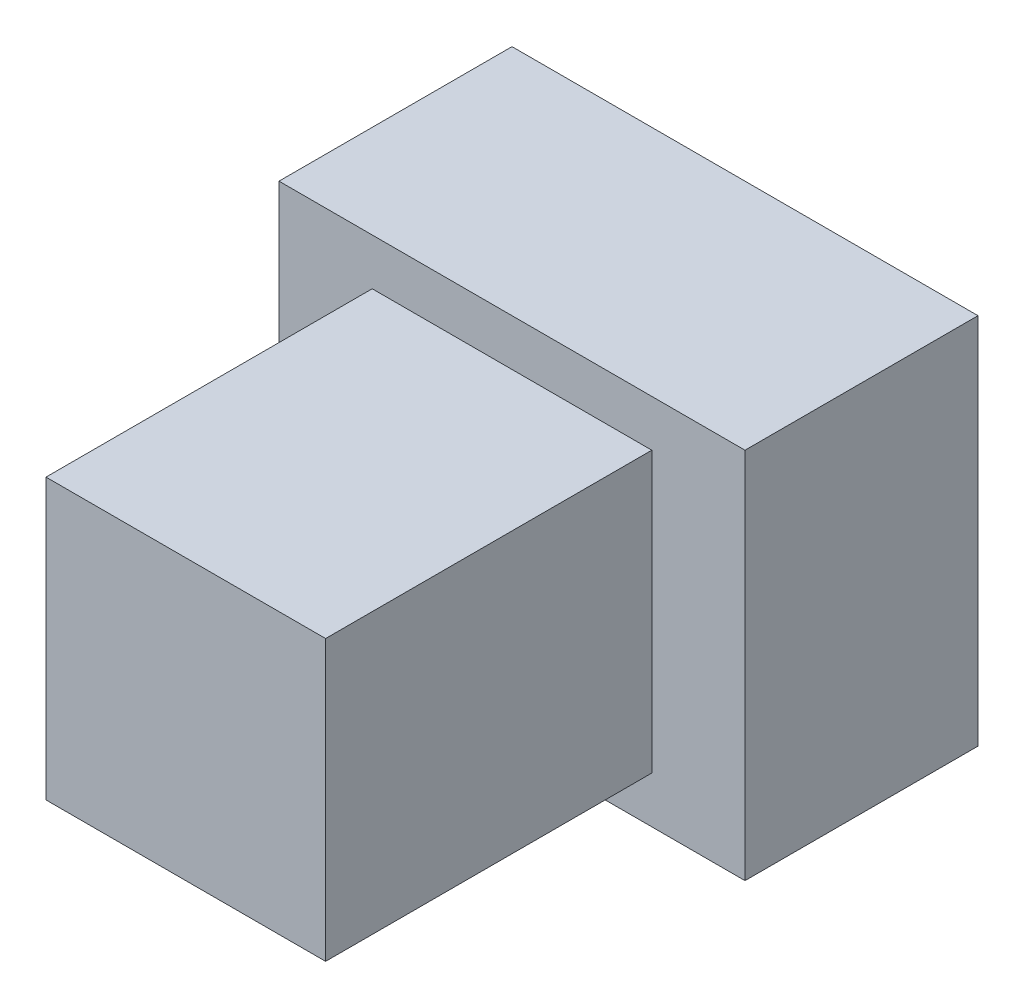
from build123d import *

# Parameters (mm, degrees)
CROQUIS1_W              = 100
CROQUIS1_H              = 80
SALIENTE_EXTRUIR1_DEPTH = 50
CROQUIS2_W              = 60
CROQUIS2_H              = 60
SALIENTE_EXTRUIR2_DEPTH = 70


with BuildPart() as part:
    # Croquis1 → Saliente-Extruir1 (new body)
    with BuildSketch(Plane.XY):
        Rectangle(CROQUIS1_W, CROQUIS1_H)
    extrude(amount=SALIENTE_EXTRUIR1_DEPTH)

    # Croquis2 → Saliente-Extruir2 (add)
    with BuildSketch(Plane.XY.offset(50)):
        Rectangle(CROQUIS2_W, CROQUIS2_H)
    extrude(amount=SALIENTE_EXTRUIR2_DEPTH)


solid = part.part
